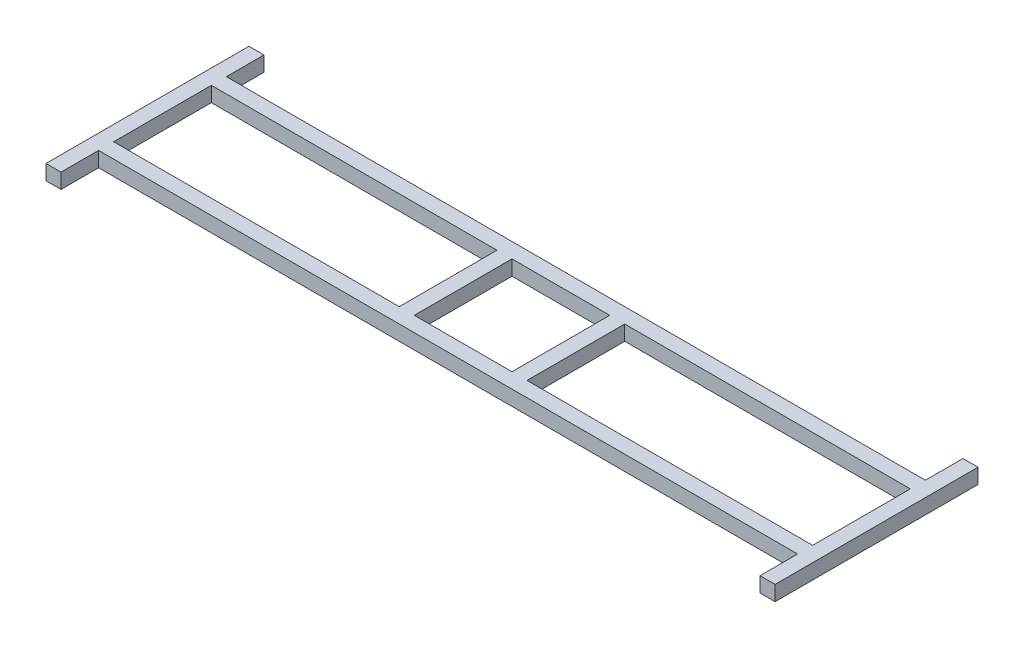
ISO-10303-21;
HEADER;
FILE_DESCRIPTION(('STEP AP214'),'2;1');
FILE_NAME('part.step','',(''),(''),'','','');
FILE_SCHEMA(('AUTOMOTIVE_DESIGN { 1 0 10303 214 1 1 1 1 }'));
ENDSEC;
DATA;
#1=APPLICATION_CONTEXT('core data for automotive mechanical design processes');
#2=APPLICATION_PROTOCOL_DEFINITION('international standard','automotive_design',2000,#1);
#3=PRODUCT_CONTEXT('',#1,'mechanical');
#4=PRODUCT('Part','Part','',(#3));
#5=PRODUCT_RELATED_PRODUCT_CATEGORY('part','',(#4));
#6=PRODUCT_DEFINITION_FORMATION('','',#4);
#7=PRODUCT_DEFINITION_CONTEXT('part definition',#1,'design');
#8=PRODUCT_DEFINITION('design','',#6,#7);
#9=PRODUCT_DEFINITION_SHAPE('','',#8);
#10=(LENGTH_UNIT() NAMED_UNIT(*) SI_UNIT(.MILLI.,.METRE.));
#11=(NAMED_UNIT(*) PLANE_ANGLE_UNIT() SI_UNIT($,.RADIAN.));
#12=(NAMED_UNIT(*) SI_UNIT($,.STERADIAN.) SOLID_ANGLE_UNIT());
#13=UNCERTAINTY_MEASURE_WITH_UNIT(LENGTH_MEASURE(1.E-05),#10,'distance_accuracy_value','');
#14=(GEOMETRIC_REPRESENTATION_CONTEXT(3) GLOBAL_UNCERTAINTY_ASSIGNED_CONTEXT((#13)) GLOBAL_UNIT_ASSIGNED_CONTEXT((#10,
#11,#12)) REPRESENTATION_CONTEXT('',''));
#15=CARTESIAN_POINT('',(0.,0.,0.));
#16=DIRECTION('',(0.,0.,1.));
#17=DIRECTION('',(1.,0.,0.));
#18=AXIS2_PLACEMENT_3D('',#15,#16,#17);
#19=CARTESIAN_POINT('',(1375.,70.,-3.42666223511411E-13));
#20=DIRECTION('',(1.,0.,0.));
#21=DIRECTION('',(0.,0.,-1.));
#22=AXIS2_PLACEMENT_3D('',#19,#20,#21);
#23=PLANE('',#22);
#24=DIRECTION('',(0.,0.,1.));
#25=VECTOR('',#24,1.);
#26=CARTESIAN_POINT('',(1375.,-30.,-3.42666223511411E-13));
#27=LINE('',#26,#25);
#28=CARTESIAN_POINT('',(1375.,-30.,-325.000000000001));
#29=VERTEX_POINT('',#28);
#30=CARTESIAN_POINT('',(1375.,-30.,325.000000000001));
#31=VERTEX_POINT('',#30);
#32=EDGE_CURVE('E398',#29,#31,#27,.T.);
#33=ORIENTED_EDGE('',*,*,#32,.F.);
#34=DIRECTION('',(0.,-1.,0.));
#35=VECTOR('',#34,1.);
#36=CARTESIAN_POINT('',(1375.,70.,-325.000000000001));
#37=LINE('',#36,#35);
#38=CARTESIAN_POINT('',(1375.,70.,-325.000000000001));
#39=VERTEX_POINT('',#38);
#40=EDGE_CURVE('E11',#39,#29,#37,.T.);
#41=ORIENTED_EDGE('',*,*,#40,.F.);
#42=DIRECTION('',(0.,0.,1.));
#43=VECTOR('',#42,1.);
#44=CARTESIAN_POINT('',(1375.,70.,-3.42666223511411E-13));
#45=LINE('',#44,#43);
#46=CARTESIAN_POINT('',(1375.,70.,325.000000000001));
#47=VERTEX_POINT('',#46);
#48=EDGE_CURVE('E230',#39,#47,#45,.T.);
#49=ORIENTED_EDGE('',*,*,#48,.T.);
#50=DIRECTION('',(0.,-1.,0.));
#51=VECTOR('',#50,1.);
#52=CARTESIAN_POINT('',(1375.,70.,325.000000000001));
#53=LINE('',#52,#51);
#54=EDGE_CURVE('E67',#47,#31,#53,.T.);
#55=ORIENTED_EDGE('',*,*,#54,.T.);
#56=EDGE_LOOP('',(#33,#41,#49,#55));
#57=FACE_BOUND('',#56,.T.);
#58=ADVANCED_FACE('F47',(#57),#23,.T.);
#59=CARTESIAN_POINT('',(-1425.,70.,-325.000000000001));
#60=DIRECTION('',(0.,0.,-1.));
#61=DIRECTION('',(-1.,0.,0.));
#62=AXIS2_PLACEMENT_3D('',#59,#60,#61);
#63=PLANE('',#62);
#64=DIRECTION('',(1.,0.,0.));
#65=VECTOR('',#64,1.);
#66=CARTESIAN_POINT('',(-1425.,-30.,-325.000000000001));
#67=LINE('',#66,#65);
#68=CARTESIAN_POINT('',(3275.,-30.,-325.000000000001));
#69=VERTEX_POINT('',#68);
#70=EDGE_CURVE('E236',#29,#69,#67,.T.);
#71=ORIENTED_EDGE('',*,*,#70,.T.);
#72=DIRECTION('',(0.,-1.,0.));
#73=VECTOR('',#72,1.);
#74=CARTESIAN_POINT('',(3275.,70.,-325.000000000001));
#75=LINE('',#74,#73);
#76=CARTESIAN_POINT('',(3275.,70.,-325.000000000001));
#77=VERTEX_POINT('',#76);
#78=EDGE_CURVE('E58',#77,#69,#75,.T.);
#79=ORIENTED_EDGE('',*,*,#78,.F.);
#80=DIRECTION('',(1.,0.,0.));
#81=VECTOR('',#80,1.);
#82=CARTESIAN_POINT('',(-1425.,70.,-325.000000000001));
#83=LINE('',#82,#81);
#84=EDGE_CURVE('E225',#39,#77,#83,.T.);
#85=ORIENTED_EDGE('',*,*,#84,.F.);
#86=ORIENTED_EDGE('',*,*,#40,.T.);
#87=EDGE_LOOP('',(#71,#79,#85,#86));
#88=FACE_BOUND('',#87,.T.);
#89=ADVANCED_FACE('F234',(#88),#63,.F.);
#90=CARTESIAN_POINT('',(3275.,70.,-4.35654946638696E-12));
#91=DIRECTION('',(1.,0.,0.));
#92=DIRECTION('',(0.,0.,-1.));
#93=AXIS2_PLACEMENT_3D('',#90,#91,#92);
#94=PLANE('',#93);
#95=DIRECTION('',(0.,0.,1.));
#96=VECTOR('',#95,1.);
#97=CARTESIAN_POINT('',(3275.,-30.,-4.35654946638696E-12));
#98=LINE('',#97,#96);
#99=CARTESIAN_POINT('',(3275.,-30.,325.000000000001));
#100=VERTEX_POINT('',#99);
#101=EDGE_CURVE('E403',#69,#100,#98,.T.);
#102=ORIENTED_EDGE('',*,*,#101,.T.);
#103=DIRECTION('',(0.,-1.,0.));
#104=VECTOR('',#103,1.);
#105=CARTESIAN_POINT('',(3275.,70.,325.000000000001));
#106=LINE('',#105,#104);
#107=CARTESIAN_POINT('',(3275.,70.,325.000000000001));
#108=VERTEX_POINT('',#107);
#109=EDGE_CURVE('E141',#108,#100,#106,.T.);
#110=ORIENTED_EDGE('',*,*,#109,.F.);
#111=DIRECTION('',(0.,0.,1.));
#112=VECTOR('',#111,1.);
#113=CARTESIAN_POINT('',(3275.,70.,-4.35654946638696E-12));
#114=LINE('',#113,#112);
#115=EDGE_CURVE('E216',#77,#108,#114,.T.);
#116=ORIENTED_EDGE('',*,*,#115,.F.);
#117=ORIENTED_EDGE('',*,*,#78,.T.);
#118=EDGE_LOOP('',(#102,#110,#116,#117));
#119=FACE_BOUND('',#118,.T.);
#120=ADVANCED_FACE('F218',(#119),#94,.F.);
#121=CARTESIAN_POINT('',(-1425.,70.,325.000000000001));
#122=DIRECTION('',(0.,0.,-1.));
#123=DIRECTION('',(-1.,0.,0.));
#124=AXIS2_PLACEMENT_3D('',#121,#122,#123);
#125=PLANE('',#124);
#126=DIRECTION('',(1.,0.,0.));
#127=VECTOR('',#126,1.);
#128=CARTESIAN_POINT('',(-1425.,-30.,325.000000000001));
#129=LINE('',#128,#127);
#130=CARTESIAN_POINT('',(-1375.,-30.,325.000000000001));
#131=VERTEX_POINT('',#130);
#132=CARTESIAN_POINT('',(525.000000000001,-30.,325.000000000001));
#133=VERTEX_POINT('',#132);
#134=EDGE_CURVE('E382',#131,#133,#129,.T.);
#135=ORIENTED_EDGE('',*,*,#134,.F.);
#136=DIRECTION('',(0.,-1.,0.));
#137=VECTOR('',#136,1.);
#138=CARTESIAN_POINT('',(-1375.,70.,325.000000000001));
#139=LINE('',#138,#137);
#140=CARTESIAN_POINT('',(-1375.,70.,325.000000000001));
#141=VERTEX_POINT('',#140);
#142=EDGE_CURVE('E255',#141,#131,#139,.T.);
#143=ORIENTED_EDGE('',*,*,#142,.F.);
#144=DIRECTION('',(1.,0.,0.));
#145=VECTOR('',#144,1.);
#146=CARTESIAN_POINT('',(-1425.,70.,325.000000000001));
#147=LINE('',#146,#145);
#148=CARTESIAN_POINT('',(525.000000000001,70.,325.000000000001));
#149=VERTEX_POINT('',#148);
#150=EDGE_CURVE('E467',#141,#149,#147,.T.);
#151=ORIENTED_EDGE('',*,*,#150,.T.);
#152=DIRECTION('',(0.,-1.,0.));
#153=VECTOR('',#152,1.);
#154=CARTESIAN_POINT('',(525.000000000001,70.,325.000000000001));
#155=LINE('',#154,#153);
#156=EDGE_CURVE('E243',#149,#133,#155,.T.);
#157=ORIENTED_EDGE('',*,*,#156,.T.);
#158=EDGE_LOOP('',(#135,#143,#151,#157));
#159=FACE_BOUND('',#158,.T.);
#160=ADVANCED_FACE('F519',(#159),#125,.T.);
#161=CARTESIAN_POINT('',(-1375.,70.,-3.76026290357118E-13));
#162=DIRECTION('',(-1.,0.,0.));
#163=DIRECTION('',(0.,0.,1.));
#164=AXIS2_PLACEMENT_3D('',#161,#162,#163);
#165=PLANE('',#164);
#166=DIRECTION('',(0.,0.,-1.));
#167=VECTOR('',#166,1.);
#168=CARTESIAN_POINT('',(-1375.,-30.,-3.76026290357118E-13));
#169=LINE('',#168,#167);
#170=CARTESIAN_POINT('',(-1375.,-30.,-325.000000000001));
#171=VERTEX_POINT('',#170);
#172=EDGE_CURVE('E386',#131,#171,#169,.T.);
#173=ORIENTED_EDGE('',*,*,#172,.T.);
#174=DIRECTION('',(0.,-1.,0.));
#175=VECTOR('',#174,1.);
#176=CARTESIAN_POINT('',(-1375.,70.,-325.000000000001));
#177=LINE('',#176,#175);
#178=CARTESIAN_POINT('',(-1375.,70.,-325.000000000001));
#179=VERTEX_POINT('',#178);
#180=EDGE_CURVE('E251',#179,#171,#177,.T.);
#181=ORIENTED_EDGE('',*,*,#180,.F.);
#182=DIRECTION('',(0.,0.,-1.));
#183=VECTOR('',#182,1.);
#184=CARTESIAN_POINT('',(-1375.,70.,-3.76026290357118E-13));
#185=LINE('',#184,#183);
#186=EDGE_CURVE('E471',#141,#179,#185,.T.);
#187=ORIENTED_EDGE('',*,*,#186,.F.);
#188=ORIENTED_EDGE('',*,*,#142,.T.);
#189=EDGE_LOOP('',(#173,#181,#187,#188));
#190=FACE_BOUND('',#189,.T.);
#191=ADVANCED_FACE('F515',(#190),#165,.F.);
#192=CARTESIAN_POINT('',(-1425.,70.,-325.000000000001));
#193=DIRECTION('',(0.,0.,-1.));
#194=DIRECTION('',(-1.,0.,0.));
#195=AXIS2_PLACEMENT_3D('',#192,#193,#194);
#196=PLANE('',#195);
#197=DIRECTION('',(1.,0.,0.));
#198=VECTOR('',#197,1.);
#199=CARTESIAN_POINT('',(-1425.,-30.,-325.000000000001));
#200=LINE('',#199,#198);
#201=CARTESIAN_POINT('',(525.000000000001,-30.,-325.000000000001));
#202=VERTEX_POINT('',#201);
#203=EDGE_CURVE('E390',#171,#202,#200,.T.);
#204=ORIENTED_EDGE('',*,*,#203,.T.);
#205=DIRECTION('',(0.,-1.,0.));
#206=VECTOR('',#205,1.);
#207=CARTESIAN_POINT('',(525.000000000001,70.,-325.000000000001));
#208=LINE('',#207,#206);
#209=CARTESIAN_POINT('',(525.000000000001,70.,-325.000000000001));
#210=VERTEX_POINT('',#209);
#211=EDGE_CURVE('E246',#210,#202,#208,.T.);
#212=ORIENTED_EDGE('',*,*,#211,.F.);
#213=DIRECTION('',(1.,0.,0.));
#214=VECTOR('',#213,1.);
#215=CARTESIAN_POINT('',(-1425.,70.,-325.000000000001));
#216=LINE('',#215,#214);
#217=EDGE_CURVE('E475',#179,#210,#216,.T.);
#218=ORIENTED_EDGE('',*,*,#217,.F.);
#219=ORIENTED_EDGE('',*,*,#180,.T.);
#220=EDGE_LOOP('',(#204,#212,#218,#219));
#221=FACE_BOUND('',#220,.T.);
#222=ADVANCED_FACE('F511',(#221),#196,.F.);
#223=CARTESIAN_POINT('',(-1425.,70.,325.000000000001));
#224=DIRECTION('',(0.,0.,-1.));
#225=DIRECTION('',(-1.,0.,0.));
#226=AXIS2_PLACEMENT_3D('',#223,#224,#225);
#227=PLANE('',#226);
#228=DIRECTION('',(1.,0.,0.));
#229=VECTOR('',#228,1.);
#230=CARTESIAN_POINT('',(-1425.,-30.,325.000000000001));
#231=LINE('',#230,#229);
#232=CARTESIAN_POINT('',(625.000000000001,-30.,325.000000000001));
#233=VERTEX_POINT('',#232);
#234=CARTESIAN_POINT('',(1275.,-30.,325.000000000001));
#235=VERTEX_POINT('',#234);
#236=EDGE_CURVE('E366',#233,#235,#231,.T.);
#237=ORIENTED_EDGE('',*,*,#236,.F.);
#238=DIRECTION('',(0.,-1.,0.));
#239=VECTOR('',#238,1.);
#240=CARTESIAN_POINT('',(625.000000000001,70.,325.000000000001));
#241=LINE('',#240,#239);
#242=CARTESIAN_POINT('',(625.000000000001,70.,325.000000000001));
#243=VERTEX_POINT('',#242);
#244=EDGE_CURVE('E247',#243,#233,#241,.T.);
#245=ORIENTED_EDGE('',*,*,#244,.F.);
#246=DIRECTION('',(1.,0.,0.));
#247=VECTOR('',#246,1.);
#248=CARTESIAN_POINT('',(-1425.,70.,325.000000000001));
#249=LINE('',#248,#247);
#250=CARTESIAN_POINT('',(1275.,70.,325.000000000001));
#251=VERTEX_POINT('',#250);
#252=EDGE_CURVE('E452',#243,#251,#249,.T.);
#253=ORIENTED_EDGE('',*,*,#252,.T.);
#254=DIRECTION('',(0.,-1.,0.));
#255=VECTOR('',#254,1.);
#256=CARTESIAN_POINT('',(1275.,70.,325.000000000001));
#257=LINE('',#256,#255);
#258=EDGE_CURVE('E258',#251,#235,#257,.T.);
#259=ORIENTED_EDGE('',*,*,#258,.T.);
#260=EDGE_LOOP('',(#237,#245,#253,#259));
#261=FACE_BOUND('',#260,.T.);
#262=ADVANCED_FACE('F514',(#261),#227,.T.);
#263=CARTESIAN_POINT('',(625.000000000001,70.,-3.42666223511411E-13));
#264=DIRECTION('',(1.,0.,0.));
#265=DIRECTION('',(0.,0.,-1.));
#266=AXIS2_PLACEMENT_3D('',#263,#264,#265);
#267=PLANE('',#266);
#268=DIRECTION('',(0.,0.,1.));
#269=VECTOR('',#268,1.);
#270=CARTESIAN_POINT('',(625.000000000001,-30.,-3.42666223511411E-13));
#271=LINE('',#270,#269);
#272=CARTESIAN_POINT('',(625.000000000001,-30.,-325.000000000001));
#273=VERTEX_POINT('',#272);
#274=EDGE_CURVE('E370',#273,#233,#271,.T.);
#275=ORIENTED_EDGE('',*,*,#274,.F.);
#276=DIRECTION('',(0.,-1.,0.));
#277=VECTOR('',#276,1.);
#278=CARTESIAN_POINT('',(625.000000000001,70.,-325.000000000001));
#279=LINE('',#278,#277);
#280=CARTESIAN_POINT('',(625.000000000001,70.,-325.000000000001));
#281=VERTEX_POINT('',#280);
#282=EDGE_CURVE('E265',#281,#273,#279,.T.);
#283=ORIENTED_EDGE('',*,*,#282,.F.);
#284=DIRECTION('',(0.,0.,1.));
#285=VECTOR('',#284,1.);
#286=CARTESIAN_POINT('',(625.000000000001,70.,-3.42666223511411E-13));
#287=LINE('',#286,#285);
#288=EDGE_CURVE('E456',#281,#243,#287,.T.);
#289=ORIENTED_EDGE('',*,*,#288,.T.);
#290=ORIENTED_EDGE('',*,*,#244,.T.);
#291=EDGE_LOOP('',(#275,#283,#289,#290));
#292=FACE_BOUND('',#291,.T.);
#293=ADVANCED_FACE('F530',(#292),#267,.T.);
#294=CARTESIAN_POINT('',(-1425.,70.,-325.000000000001));
#295=DIRECTION('',(0.,0.,-1.));
#296=DIRECTION('',(-1.,0.,0.));
#297=AXIS2_PLACEMENT_3D('',#294,#295,#296);
#298=PLANE('',#297);
#299=DIRECTION('',(1.,0.,0.));
#300=VECTOR('',#299,1.);
#301=CARTESIAN_POINT('',(-1425.,-30.,-325.000000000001));
#302=LINE('',#301,#300);
#303=CARTESIAN_POINT('',(1275.,-30.,-325.000000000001));
#304=VERTEX_POINT('',#303);
#305=EDGE_CURVE('E374',#273,#304,#302,.T.);
#306=ORIENTED_EDGE('',*,*,#305,.T.);
#307=DIRECTION('',(0.,-1.,0.));
#308=VECTOR('',#307,1.);
#309=CARTESIAN_POINT('',(1275.,70.,-325.000000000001));
#310=LINE('',#309,#308);
#311=CARTESIAN_POINT('',(1275.,70.,-325.000000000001));
#312=VERTEX_POINT('',#311);
#313=EDGE_CURVE('E261',#312,#304,#310,.T.);
#314=ORIENTED_EDGE('',*,*,#313,.F.);
#315=DIRECTION('',(1.,0.,0.));
#316=VECTOR('',#315,1.);
#317=CARTESIAN_POINT('',(-1425.,70.,-325.000000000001));
#318=LINE('',#317,#316);
#319=EDGE_CURVE('E460',#281,#312,#318,.T.);
#320=ORIENTED_EDGE('',*,*,#319,.F.);
#321=ORIENTED_EDGE('',*,*,#282,.T.);
#322=EDGE_LOOP('',(#306,#314,#320,#321));
#323=FACE_BOUND('',#322,.T.);
#324=ADVANCED_FACE('F527',(#323),#298,.F.);
#325=CARTESIAN_POINT('',(-1425.,70.,675.));
#326=DIRECTION('',(0.,0.,1.));
#327=DIRECTION('',(1.,0.,0.));
#328=AXIS2_PLACEMENT_3D('',#325,#326,#327);
#329=PLANE('',#328);
#330=DIRECTION('',(-1.,0.,0.));
#331=VECTOR('',#330,1.);
#332=CARTESIAN_POINT('',(-1425.,-30.,675.));
#333=LINE('',#332,#331);
#334=CARTESIAN_POINT('',(3375.,-30.,675.));
#335=VERTEX_POINT('',#334);
#336=CARTESIAN_POINT('',(3275.,-30.,675.));
#337=VERTEX_POINT('',#336);
#338=EDGE_CURVE('E317',#335,#337,#333,.T.);
#339=ORIENTED_EDGE('',*,*,#338,.F.);
#340=DIRECTION('',(0.,-1.,0.));
#341=VECTOR('',#340,1.);
#342=CARTESIAN_POINT('',(3375.,70.,675.));
#343=LINE('',#342,#341);
#344=CARTESIAN_POINT('',(3375.,70.,675.));
#345=VERTEX_POINT('',#344);
#346=EDGE_CURVE('E51',#345,#335,#343,.T.);
#347=ORIENTED_EDGE('',*,*,#346,.F.);
#348=DIRECTION('',(-1.,0.,0.));
#349=VECTOR('',#348,1.);
#350=CARTESIAN_POINT('',(-1425.,70.,675.));
#351=LINE('',#350,#349);
#352=CARTESIAN_POINT('',(3275.,70.,675.));
#353=VERTEX_POINT('',#352);
#354=EDGE_CURVE('E409',#345,#353,#351,.T.);
#355=ORIENTED_EDGE('',*,*,#354,.T.);
#356=DIRECTION('',(0.,-1.,0.));
#357=VECTOR('',#356,1.);
#358=CARTESIAN_POINT('',(3275.,70.,675.));
#359=LINE('',#358,#357);
#360=EDGE_CURVE('E270',#353,#337,#359,.T.);
#361=ORIENTED_EDGE('',*,*,#360,.T.);
#362=EDGE_LOOP('',(#339,#347,#355,#361));
#363=FACE_BOUND('',#362,.T.);
#364=ADVANCED_FACE('F49',(#363),#329,.T.);
#365=CARTESIAN_POINT('',(3375.,70.,-3.42666223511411E-13));
#366=DIRECTION('',(1.,0.,0.));
#367=DIRECTION('',(0.,0.,-1.));
#368=AXIS2_PLACEMENT_3D('',#365,#366,#367);
#369=PLANE('',#368);
#370=DIRECTION('',(0.,0.,1.));
#371=VECTOR('',#370,1.);
#372=CARTESIAN_POINT('',(3375.,-30.,-3.42666223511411E-13));
#373=LINE('',#372,#371);
#374=CARTESIAN_POINT('',(3375.,-30.,-675.));
#375=VERTEX_POINT('',#374);
#376=EDGE_CURVE('E312',#375,#335,#373,.T.);
#377=ORIENTED_EDGE('',*,*,#376,.F.);
#378=DIRECTION('',(0.,-1.,0.));
#379=VECTOR('',#378,1.);
#380=CARTESIAN_POINT('',(3375.,70.,-675.));
#381=LINE('',#380,#379);
#382=CARTESIAN_POINT('',(3375.,70.,-675.));
#383=VERTEX_POINT('',#382);
#384=EDGE_CURVE('E301',#383,#375,#381,.T.);
#385=ORIENTED_EDGE('',*,*,#384,.F.);
#386=DIRECTION('',(0.,0.,1.));
#387=VECTOR('',#386,1.);
#388=CARTESIAN_POINT('',(3375.,70.,-3.42666223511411E-13));
#389=LINE('',#388,#387);
#390=EDGE_CURVE('E315',#383,#345,#389,.T.);
#391=ORIENTED_EDGE('',*,*,#390,.T.);
#392=ORIENTED_EDGE('',*,*,#346,.T.);
#393=EDGE_LOOP('',(#377,#385,#391,#392));
#394=FACE_BOUND('',#393,.T.);
#395=ADVANCED_FACE('F310',(#394),#369,.T.);
#396=CARTESIAN_POINT('',(-1425.,70.,-675.));
#397=DIRECTION('',(0.,0.,-1.));
#398=DIRECTION('',(-1.,0.,0.));
#399=AXIS2_PLACEMENT_3D('',#396,#397,#398);
#400=PLANE('',#399);
#401=DIRECTION('',(1.,0.,0.));
#402=VECTOR('',#401,1.);
#403=CARTESIAN_POINT('',(-1425.,-30.,-675.));
#404=LINE('',#403,#402);
#405=CARTESIAN_POINT('',(3275.,-30.,-675.));
#406=VERTEX_POINT('',#405);
#407=EDGE_CURVE('E327',#406,#375,#404,.T.);
#408=ORIENTED_EDGE('',*,*,#407,.F.);
#409=DIRECTION('',(0.,-1.,0.));
#410=VECTOR('',#409,1.);
#411=CARTESIAN_POINT('',(3275.,70.,-675.));
#412=LINE('',#411,#410);
#413=CARTESIAN_POINT('',(3275.,70.,-675.));
#414=VERTEX_POINT('',#413);
#415=EDGE_CURVE('E299',#414,#406,#412,.T.);
#416=ORIENTED_EDGE('',*,*,#415,.F.);
#417=DIRECTION('',(1.,0.,0.));
#418=VECTOR('',#417,1.);
#419=CARTESIAN_POINT('',(-1425.,70.,-675.));
#420=LINE('',#419,#418);
#421=EDGE_CURVE('E415',#414,#383,#420,.T.);
#422=ORIENTED_EDGE('',*,*,#421,.T.);
#423=ORIENTED_EDGE('',*,*,#384,.T.);
#424=EDGE_LOOP('',(#408,#416,#422,#423));
#425=FACE_BOUND('',#424,.T.);
#426=ADVANCED_FACE('F568',(#425),#400,.T.);
#427=CARTESIAN_POINT('',(3275.,70.,-3.42666223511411E-13));
#428=DIRECTION('',(-1.,0.,0.));
#429=DIRECTION('',(0.,0.,1.));
#430=AXIS2_PLACEMENT_3D('',#427,#428,#429);
#431=PLANE('',#430);
#432=DIRECTION('',(0.,0.,-1.));
#433=VECTOR('',#432,1.);
#434=CARTESIAN_POINT('',(3275.,-30.,-3.42666223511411E-13));
#435=LINE('',#434,#433);
#436=CARTESIAN_POINT('',(3275.,-30.,-425.000000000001));
#437=VERTEX_POINT('',#436);
#438=EDGE_CURVE('E331',#437,#406,#435,.T.);
#439=ORIENTED_EDGE('',*,*,#438,.F.);
#440=DIRECTION('',(0.,-1.,0.));
#441=VECTOR('',#440,1.);
#442=CARTESIAN_POINT('',(3275.,70.,-425.000000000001));
#443=LINE('',#442,#441);
#444=CARTESIAN_POINT('',(3275.,70.,-425.000000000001));
#445=VERTEX_POINT('',#444);
#446=EDGE_CURVE('E296',#445,#437,#443,.T.);
#447=ORIENTED_EDGE('',*,*,#446,.F.);
#448=DIRECTION('',(0.,0.,-1.));
#449=VECTOR('',#448,1.);
#450=CARTESIAN_POINT('',(3275.,70.,-3.42666223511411E-13));
#451=LINE('',#450,#449);
#452=EDGE_CURVE('E420',#445,#414,#451,.T.);
#453=ORIENTED_EDGE('',*,*,#452,.T.);
#454=ORIENTED_EDGE('',*,*,#415,.T.);
#455=EDGE_LOOP('',(#439,#447,#453,#454));
#456=FACE_BOUND('',#455,.T.);
#457=ADVANCED_FACE('F564',(#456),#431,.T.);
#458=CARTESIAN_POINT('',(-1425.,70.,-425.000000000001));
#459=DIRECTION('',(0.,0.,-1.));
#460=DIRECTION('',(-1.,0.,0.));
#461=AXIS2_PLACEMENT_3D('',#458,#459,#460);
#462=PLANE('',#461);
#463=DIRECTION('',(1.,0.,0.));
#464=VECTOR('',#463,1.);
#465=CARTESIAN_POINT('',(-1425.,-30.,-425.000000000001));
#466=LINE('',#465,#464);
#467=CARTESIAN_POINT('',(-1375.,-30.,-425.000000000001));
#468=VERTEX_POINT('',#467);
#469=EDGE_CURVE('E337',#468,#437,#466,.T.);
#470=ORIENTED_EDGE('',*,*,#469,.F.);
#471=DIRECTION('',(0.,-1.,0.));
#472=VECTOR('',#471,1.);
#473=CARTESIAN_POINT('',(-1375.,70.,-425.000000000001));
#474=LINE('',#473,#472);
#475=CARTESIAN_POINT('',(-1375.,70.,-425.000000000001));
#476=VERTEX_POINT('',#475);
#477=EDGE_CURVE('E293',#476,#468,#474,.T.);
#478=ORIENTED_EDGE('',*,*,#477,.F.);
#479=DIRECTION('',(1.,0.,0.));
#480=VECTOR('',#479,1.);
#481=CARTESIAN_POINT('',(-1425.,70.,-425.000000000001));
#482=LINE('',#481,#480);
#483=EDGE_CURVE('E424',#476,#445,#482,.T.);
#484=ORIENTED_EDGE('',*,*,#483,.T.);
#485=ORIENTED_EDGE('',*,*,#446,.T.);
#486=EDGE_LOOP('',(#470,#478,#484,#485));
#487=FACE_BOUND('',#486,.T.);
#488=ADVANCED_FACE('F560',(#487),#462,.T.);
#489=CARTESIAN_POINT('',(-1375.,70.,-3.42666223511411E-13));
#490=DIRECTION('',(-1.,0.,0.));
#491=DIRECTION('',(0.,0.,1.));
#492=AXIS2_PLACEMENT_3D('',#489,#490,#491);
#493=PLANE('',#492);
#494=DIRECTION('',(0.,0.,-1.));
#495=VECTOR('',#494,1.);
#496=CARTESIAN_POINT('',(-1375.,-30.,-3.42666223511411E-13));
#497=LINE('',#496,#495);
#498=CARTESIAN_POINT('',(-1375.,-30.,-675.000000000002));
#499=VERTEX_POINT('',#498);
#500=EDGE_CURVE('E341',#468,#499,#497,.T.);
#501=ORIENTED_EDGE('',*,*,#500,.T.);
#502=DIRECTION('',(0.,-1.,0.));
#503=VECTOR('',#502,1.);
#504=CARTESIAN_POINT('',(-1375.,70.,-675.000000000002));
#505=LINE('',#504,#503);
#506=CARTESIAN_POINT('',(-1375.,70.,-675.000000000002));
#507=VERTEX_POINT('',#506);
#508=EDGE_CURVE('E289',#507,#499,#505,.T.);
#509=ORIENTED_EDGE('',*,*,#508,.F.);
#510=DIRECTION('',(0.,0.,-1.));
#511=VECTOR('',#510,1.);
#512=CARTESIAN_POINT('',(-1375.,70.,-3.42666223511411E-13));
#513=LINE('',#512,#511);
#514=EDGE_CURVE('E428',#476,#507,#513,.T.);
#515=ORIENTED_EDGE('',*,*,#514,.F.);
#516=ORIENTED_EDGE('',*,*,#477,.T.);
#517=EDGE_LOOP('',(#501,#509,#515,#516));
#518=FACE_BOUND('',#517,.T.);
#519=ADVANCED_FACE('F556',(#518),#493,.F.);
#520=CARTESIAN_POINT('',(-1425.,70.,-675.000000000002));
#521=DIRECTION('',(0.,0.,1.));
#522=DIRECTION('',(1.,0.,0.));
#523=AXIS2_PLACEMENT_3D('',#520,#521,#522);
#524=PLANE('',#523);
#525=DIRECTION('',(-1.,0.,0.));
#526=VECTOR('',#525,1.);
#527=CARTESIAN_POINT('',(-1425.,-30.,-675.000000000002));
#528=LINE('',#527,#526);
#529=CARTESIAN_POINT('',(-1475.,-30.,-675.000000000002));
#530=VERTEX_POINT('',#529);
#531=EDGE_CURVE('E344',#499,#530,#528,.T.);
#532=ORIENTED_EDGE('',*,*,#531,.T.);
#533=DIRECTION('',(0.,-1.,0.));
#534=VECTOR('',#533,1.);
#535=CARTESIAN_POINT('',(-1475.,70.,-675.000000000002));
#536=LINE('',#535,#534);
#537=CARTESIAN_POINT('',(-1475.,70.,-675.000000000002));
#538=VERTEX_POINT('',#537);
#539=EDGE_CURVE('E286',#538,#530,#536,.T.);
#540=ORIENTED_EDGE('',*,*,#539,.F.);
#541=DIRECTION('',(-1.,0.,0.));
#542=VECTOR('',#541,1.);
#543=CARTESIAN_POINT('',(-1425.,70.,-675.000000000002));
#544=LINE('',#543,#542);
#545=EDGE_CURVE('E431',#507,#538,#544,.T.);
#546=ORIENTED_EDGE('',*,*,#545,.F.);
#547=ORIENTED_EDGE('',*,*,#508,.T.);
#548=EDGE_LOOP('',(#532,#540,#546,#547));
#549=FACE_BOUND('',#548,.T.);
#550=ADVANCED_FACE('F552',(#549),#524,.F.);
#551=CARTESIAN_POINT('',(-1475.,70.,-3.65795869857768E-13));
#552=DIRECTION('',(-1.,0.,0.));
#553=DIRECTION('',(0.,0.,1.));
#554=AXIS2_PLACEMENT_3D('',#551,#552,#553);
#555=PLANE('',#554);
#556=DIRECTION('',(0.,0.,-1.));
#557=VECTOR('',#556,1.);
#558=CARTESIAN_POINT('',(-1475.,-30.,-3.65795869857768E-13));
#559=LINE('',#558,#557);
#560=CARTESIAN_POINT('',(-1475.,-30.,675.000000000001));
#561=VERTEX_POINT('',#560);
#562=EDGE_CURVE('E348',#561,#530,#559,.T.);
#563=ORIENTED_EDGE('',*,*,#562,.F.);
#564=DIRECTION('',(0.,-1.,0.));
#565=VECTOR('',#564,1.);
#566=CARTESIAN_POINT('',(-1475.,70.,675.000000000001));
#567=LINE('',#566,#565);
#568=CARTESIAN_POINT('',(-1475.,70.,675.000000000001));
#569=VERTEX_POINT('',#568);
#570=EDGE_CURVE('E283',#569,#561,#567,.T.);
#571=ORIENTED_EDGE('',*,*,#570,.F.);
#572=DIRECTION('',(0.,0.,-1.));
#573=VECTOR('',#572,1.);
#574=CARTESIAN_POINT('',(-1475.,70.,-3.65795869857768E-13));
#575=LINE('',#574,#573);
#576=EDGE_CURVE('E434',#569,#538,#575,.T.);
#577=ORIENTED_EDGE('',*,*,#576,.T.);
#578=ORIENTED_EDGE('',*,*,#539,.T.);
#579=EDGE_LOOP('',(#563,#571,#577,#578));
#580=FACE_BOUND('',#579,.T.);
#581=ADVANCED_FACE('F548',(#580),#555,.T.);
#582=CARTESIAN_POINT('',(-1425.,70.,675.000000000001));
#583=DIRECTION('',(0.,0.,1.));
#584=DIRECTION('',(1.,0.,0.));
#585=AXIS2_PLACEMENT_3D('',#582,#583,#584);
#586=PLANE('',#585);
#587=DIRECTION('',(-1.,0.,0.));
#588=VECTOR('',#587,1.);
#589=CARTESIAN_POINT('',(-1425.,-30.,675.000000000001));
#590=LINE('',#589,#588);
#591=CARTESIAN_POINT('',(-1375.,-30.,675.000000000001));
#592=VERTEX_POINT('',#591);
#593=EDGE_CURVE('E352',#592,#561,#590,.T.);
#594=ORIENTED_EDGE('',*,*,#593,.F.);
#595=DIRECTION('',(0.,-1.,0.));
#596=VECTOR('',#595,1.);
#597=CARTESIAN_POINT('',(-1375.,70.,675.000000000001));
#598=LINE('',#597,#596);
#599=CARTESIAN_POINT('',(-1375.,70.,675.000000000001));
#600=VERTEX_POINT('',#599);
#601=EDGE_CURVE('E280',#600,#592,#598,.T.);
#602=ORIENTED_EDGE('',*,*,#601,.F.);
#603=DIRECTION('',(-1.,0.,0.));
#604=VECTOR('',#603,1.);
#605=CARTESIAN_POINT('',(-1425.,70.,675.000000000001));
#606=LINE('',#605,#604);
#607=EDGE_CURVE('E438',#600,#569,#606,.T.);
#608=ORIENTED_EDGE('',*,*,#607,.T.);
#609=ORIENTED_EDGE('',*,*,#570,.T.);
#610=EDGE_LOOP('',(#594,#602,#608,#609));
#611=FACE_BOUND('',#610,.T.);
#612=ADVANCED_FACE('F544',(#611),#586,.T.);
#613=CARTESIAN_POINT('',(-1375.,70.,-3.47870393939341E-13));
#614=DIRECTION('',(1.,0.,0.));
#615=DIRECTION('',(0.,0.,-1.));
#616=AXIS2_PLACEMENT_3D('',#613,#614,#615);
#617=PLANE('',#616);
#618=DIRECTION('',(0.,0.,1.));
#619=VECTOR('',#618,1.);
#620=CARTESIAN_POINT('',(-1375.,-30.,-3.47870393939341E-13));
#621=LINE('',#620,#619);
#622=CARTESIAN_POINT('',(-1375.,-30.,425.000000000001));
#623=VERTEX_POINT('',#622);
#624=EDGE_CURVE('E356',#623,#592,#621,.T.);
#625=ORIENTED_EDGE('',*,*,#624,.F.);
#626=DIRECTION('',(0.,-1.,0.));
#627=VECTOR('',#626,1.);
#628=CARTESIAN_POINT('',(-1375.,70.,425.000000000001));
#629=LINE('',#628,#627);
#630=CARTESIAN_POINT('',(-1375.,70.,425.000000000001));
#631=VERTEX_POINT('',#630);
#632=EDGE_CURVE('E277',#631,#623,#629,.T.);
#633=ORIENTED_EDGE('',*,*,#632,.F.);
#634=DIRECTION('',(0.,0.,1.));
#635=VECTOR('',#634,1.);
#636=CARTESIAN_POINT('',(-1375.,70.,-3.47870393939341E-13));
#637=LINE('',#636,#635);
#638=EDGE_CURVE('E442',#631,#600,#637,.T.);
#639=ORIENTED_EDGE('',*,*,#638,.T.);
#640=ORIENTED_EDGE('',*,*,#601,.T.);
#641=EDGE_LOOP('',(#625,#633,#639,#640));
#642=FACE_BOUND('',#641,.T.);
#643=ADVANCED_FACE('F540',(#642),#617,.T.);
#644=CARTESIAN_POINT('',(-1425.,70.,425.000000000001));
#645=DIRECTION('',(0.,0.,-1.));
#646=DIRECTION('',(-1.,0.,0.));
#647=AXIS2_PLACEMENT_3D('',#644,#645,#646);
#648=PLANE('',#647);
#649=DIRECTION('',(1.,0.,0.));
#650=VECTOR('',#649,1.);
#651=CARTESIAN_POINT('',(-1425.,-30.,425.000000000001));
#652=LINE('',#651,#650);
#653=CARTESIAN_POINT('',(3275.,-30.,425.000000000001));
#654=VERTEX_POINT('',#653);
#655=EDGE_CURVE('E360',#623,#654,#652,.T.);
#656=ORIENTED_EDGE('',*,*,#655,.T.);
#657=DIRECTION('',(0.,-1.,0.));
#658=VECTOR('',#657,1.);
#659=CARTESIAN_POINT('',(3275.,70.,425.000000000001));
#660=LINE('',#659,#658);
#661=CARTESIAN_POINT('',(3275.,70.,425.000000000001));
#662=VERTEX_POINT('',#661);
#663=EDGE_CURVE('E273',#662,#654,#660,.T.);
#664=ORIENTED_EDGE('',*,*,#663,.F.);
#665=DIRECTION('',(1.,0.,0.));
#666=VECTOR('',#665,1.);
#667=CARTESIAN_POINT('',(-1425.,70.,425.000000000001));
#668=LINE('',#667,#666);
#669=EDGE_CURVE('E446',#631,#662,#668,.T.);
#670=ORIENTED_EDGE('',*,*,#669,.F.);
#671=ORIENTED_EDGE('',*,*,#632,.T.);
#672=EDGE_LOOP('',(#656,#664,#670,#671));
#673=FACE_BOUND('',#672,.T.);
#674=ADVANCED_FACE('F509',(#673),#648,.F.);
#675=CARTESIAN_POINT('',(525.000000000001,70.,-3.42666223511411E-13));
#676=DIRECTION('',(1.,0.,0.));
#677=DIRECTION('',(0.,0.,-1.));
#678=AXIS2_PLACEMENT_3D('',#675,#676,#677);
#679=PLANE('',#678);
#680=DIRECTION('',(0.,0.,1.));
#681=VECTOR('',#680,1.);
#682=CARTESIAN_POINT('',(525.000000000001,-30.,-3.42666223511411E-13));
#683=LINE('',#682,#681);
#684=EDGE_CURVE('E394',#202,#133,#683,.T.);
#685=ORIENTED_EDGE('',*,*,#684,.T.);
#686=ORIENTED_EDGE('',*,*,#156,.F.);
#687=DIRECTION('',(0.,0.,1.));
#688=VECTOR('',#687,1.);
#689=CARTESIAN_POINT('',(525.000000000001,70.,-3.42666223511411E-13));
#690=LINE('',#689,#688);
#691=EDGE_CURVE('E479',#210,#149,#690,.T.);
#692=ORIENTED_EDGE('',*,*,#691,.F.);
#693=ORIENTED_EDGE('',*,*,#211,.T.);
#694=EDGE_LOOP('',(#685,#686,#692,#693));
#695=FACE_BOUND('',#694,.T.);
#696=ADVANCED_FACE('F506',(#695),#679,.F.);
#697=CARTESIAN_POINT('',(1275.,70.,-3.42666223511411E-13));
#698=DIRECTION('',(1.,0.,0.));
#699=DIRECTION('',(0.,0.,-1.));
#700=AXIS2_PLACEMENT_3D('',#697,#698,#699);
#701=PLANE('',#700);
#702=DIRECTION('',(0.,0.,1.));
#703=VECTOR('',#702,1.);
#704=CARTESIAN_POINT('',(1275.,-30.,-3.42666223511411E-13));
#705=LINE('',#704,#703);
#706=EDGE_CURVE('E378',#304,#235,#705,.T.);
#707=ORIENTED_EDGE('',*,*,#706,.T.);
#708=ORIENTED_EDGE('',*,*,#258,.F.);
#709=DIRECTION('',(0.,0.,1.));
#710=VECTOR('',#709,1.);
#711=CARTESIAN_POINT('',(1275.,70.,-3.42666223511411E-13));
#712=LINE('',#711,#710);
#713=EDGE_CURVE('E464',#312,#251,#712,.T.);
#714=ORIENTED_EDGE('',*,*,#713,.F.);
#715=ORIENTED_EDGE('',*,*,#313,.T.);
#716=EDGE_LOOP('',(#707,#708,#714,#715));
#717=FACE_BOUND('',#716,.T.);
#718=ADVANCED_FACE('F494',(#717),#701,.F.);
#719=CARTESIAN_POINT('',(3275.,70.,1.00934302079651E-11));
#720=DIRECTION('',(1.,0.,0.));
#721=DIRECTION('',(0.,0.,-1.));
#722=AXIS2_PLACEMENT_3D('',#719,#720,#721);
#723=PLANE('',#722);
#724=DIRECTION('',(0.,0.,1.));
#725=VECTOR('',#724,1.);
#726=CARTESIAN_POINT('',(3275.,-30.,1.00934302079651E-11));
#727=LINE('',#726,#725);
#728=EDGE_CURVE('E363',#654,#337,#727,.T.);
#729=ORIENTED_EDGE('',*,*,#728,.T.);
#730=ORIENTED_EDGE('',*,*,#360,.F.);
#731=DIRECTION('',(0.,0.,1.));
#732=VECTOR('',#731,1.);
#733=CARTESIAN_POINT('',(3275.,70.,1.00934302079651E-11));
#734=LINE('',#733,#732);
#735=EDGE_CURVE('E449',#662,#353,#734,.T.);
#736=ORIENTED_EDGE('',*,*,#735,.F.);
#737=ORIENTED_EDGE('',*,*,#663,.T.);
#738=EDGE_LOOP('',(#729,#730,#736,#737));
#739=FACE_BOUND('',#738,.T.);
#740=ADVANCED_FACE('F486',(#739),#723,.F.);
#741=CARTESIAN_POINT('',(-1425.,70.,325.000000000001));
#742=DIRECTION('',(0.,0.,-1.));
#743=DIRECTION('',(-1.,0.,0.));
#744=AXIS2_PLACEMENT_3D('',#741,#742,#743);
#745=PLANE('',#744);
#746=DIRECTION('',(1.,0.,0.));
#747=VECTOR('',#746,1.);
#748=CARTESIAN_POINT('',(-1425.,-30.,325.000000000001));
#749=LINE('',#748,#747);
#750=EDGE_CURVE('E406',#31,#100,#749,.T.);
#751=ORIENTED_EDGE('',*,*,#750,.F.);
#752=ORIENTED_EDGE('',*,*,#54,.F.);
#753=DIRECTION('',(1.,0.,0.));
#754=VECTOR('',#753,1.);
#755=CARTESIAN_POINT('',(-1425.,70.,325.000000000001));
#756=LINE('',#755,#754);
#757=EDGE_CURVE('E224',#47,#108,#756,.T.);
#758=ORIENTED_EDGE('',*,*,#757,.T.);
#759=ORIENTED_EDGE('',*,*,#109,.T.);
#760=EDGE_LOOP('',(#751,#752,#758,#759));
#761=FACE_BOUND('',#760,.T.);
#762=ADVANCED_FACE('F484',(#761),#745,.T.);
#763=CARTESIAN_POINT('',(-1425.,70.,-3.42666223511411E-13));
#764=DIRECTION('',(0.,1.,0.));
#765=DIRECTION('',(0.,0.,1.));
#766=AXIS2_PLACEMENT_3D('',#763,#764,#765);
#767=PLANE('',#766);
#768=ORIENTED_EDGE('',*,*,#354,.F.);
#769=ORIENTED_EDGE('',*,*,#390,.F.);
#770=ORIENTED_EDGE('',*,*,#421,.F.);
#771=ORIENTED_EDGE('',*,*,#452,.F.);
#772=ORIENTED_EDGE('',*,*,#483,.F.);
#773=ORIENTED_EDGE('',*,*,#514,.T.);
#774=ORIENTED_EDGE('',*,*,#545,.T.);
#775=ORIENTED_EDGE('',*,*,#576,.F.);
#776=ORIENTED_EDGE('',*,*,#607,.F.);
#777=ORIENTED_EDGE('',*,*,#638,.F.);
#778=ORIENTED_EDGE('',*,*,#669,.T.);
#779=ORIENTED_EDGE('',*,*,#735,.T.);
#780=EDGE_LOOP('',(#768,#769,#770,#771,#772,#773,#774,#775,#776,#777,#778,#779));
#781=FACE_BOUND('',#780,.T.);
#782=ORIENTED_EDGE('',*,*,#252,.F.);
#783=ORIENTED_EDGE('',*,*,#288,.F.);
#784=ORIENTED_EDGE('',*,*,#319,.T.);
#785=ORIENTED_EDGE('',*,*,#713,.T.);
#786=EDGE_LOOP('',(#782,#783,#784,#785));
#787=FACE_BOUND('',#786,.T.);
#788=ORIENTED_EDGE('',*,*,#150,.F.);
#789=ORIENTED_EDGE('',*,*,#186,.T.);
#790=ORIENTED_EDGE('',*,*,#217,.T.);
#791=ORIENTED_EDGE('',*,*,#691,.T.);
#792=EDGE_LOOP('',(#788,#789,#790,#791));
#793=FACE_BOUND('',#792,.T.);
#794=ORIENTED_EDGE('',*,*,#48,.F.);
#795=ORIENTED_EDGE('',*,*,#84,.T.);
#796=ORIENTED_EDGE('',*,*,#115,.T.);
#797=ORIENTED_EDGE('',*,*,#757,.F.);
#798=EDGE_LOOP('',(#794,#795,#796,#797));
#799=FACE_BOUND('',#798,.T.);
#800=ADVANCED_FACE('F229',(#781,#787,#793,#799),#767,.T.);
#801=CARTESIAN_POINT('',(-1425.,-30.,-3.42666223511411E-13));
#802=DIRECTION('',(0.,1.,0.));
#803=DIRECTION('',(0.,0.,1.));
#804=AXIS2_PLACEMENT_3D('',#801,#802,#803);
#805=PLANE('',#804);
#806=ORIENTED_EDGE('',*,*,#338,.T.);
#807=ORIENTED_EDGE('',*,*,#728,.F.);
#808=ORIENTED_EDGE('',*,*,#655,.F.);
#809=ORIENTED_EDGE('',*,*,#624,.T.);
#810=ORIENTED_EDGE('',*,*,#593,.T.);
#811=ORIENTED_EDGE('',*,*,#562,.T.);
#812=ORIENTED_EDGE('',*,*,#531,.F.);
#813=ORIENTED_EDGE('',*,*,#500,.F.);
#814=ORIENTED_EDGE('',*,*,#469,.T.);
#815=ORIENTED_EDGE('',*,*,#438,.T.);
#816=ORIENTED_EDGE('',*,*,#407,.T.);
#817=ORIENTED_EDGE('',*,*,#376,.T.);
#818=EDGE_LOOP('',(#806,#807,#808,#809,#810,#811,#812,#813,#814,#815,#816,#817));
#819=FACE_BOUND('',#818,.T.);
#820=ORIENTED_EDGE('',*,*,#236,.T.);
#821=ORIENTED_EDGE('',*,*,#706,.F.);
#822=ORIENTED_EDGE('',*,*,#305,.F.);
#823=ORIENTED_EDGE('',*,*,#274,.T.);
#824=EDGE_LOOP('',(#820,#821,#822,#823));
#825=FACE_BOUND('',#824,.T.);
#826=ORIENTED_EDGE('',*,*,#134,.T.);
#827=ORIENTED_EDGE('',*,*,#684,.F.);
#828=ORIENTED_EDGE('',*,*,#203,.F.);
#829=ORIENTED_EDGE('',*,*,#172,.F.);
#830=EDGE_LOOP('',(#826,#827,#828,#829));
#831=FACE_BOUND('',#830,.T.);
#832=ORIENTED_EDGE('',*,*,#32,.T.);
#833=ORIENTED_EDGE('',*,*,#750,.T.);
#834=ORIENTED_EDGE('',*,*,#101,.F.);
#835=ORIENTED_EDGE('',*,*,#70,.F.);
#836=EDGE_LOOP('',(#832,#833,#834,#835));
#837=FACE_BOUND('',#836,.T.);
#838=ADVANCED_FACE('F324',(#819,#825,#831,#837),#805,.F.);
#839=CLOSED_SHELL('',(#58,#89,#120,#160,#191,#222,#262,#293,#324,#364,#395,#426,#457,#488,#519,
#550,#581,#612,#643,#674,#696,#718,#740,#762,#800,#838));
#840=MANIFOLD_SOLID_BREP('B2',#839);
#841=ADVANCED_BREP_SHAPE_REPRESENTATION('',(#18,#840),#14);
#842=SHAPE_DEFINITION_REPRESENTATION(#9,#841);
ENDSEC;
END-ISO-10303-21;
